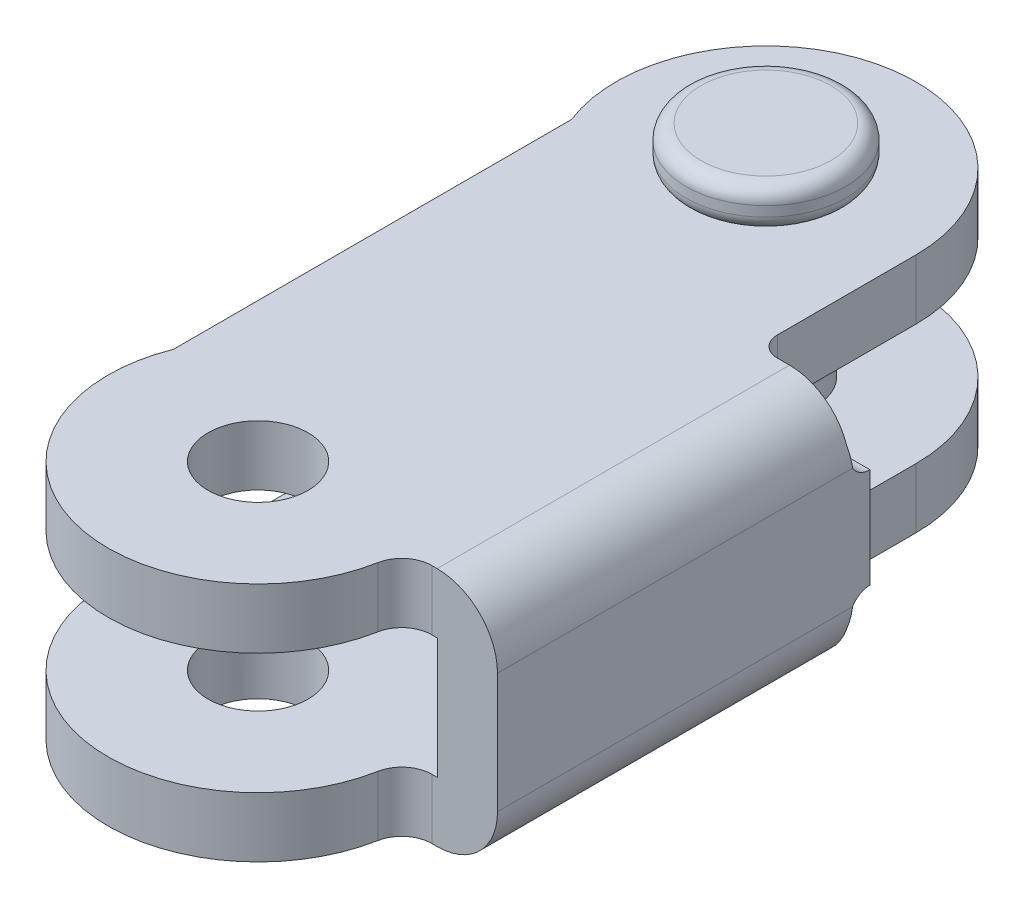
ISO-10303-21;
HEADER;
FILE_DESCRIPTION(('STEP AP214'),'2;1');
FILE_NAME('part.step','',(''),(''),'','','');
FILE_SCHEMA(('AUTOMOTIVE_DESIGN { 1 0 10303 214 1 1 1 1 }'));
ENDSEC;
DATA;
#1=APPLICATION_CONTEXT('core data for automotive mechanical design processes');
#2=APPLICATION_PROTOCOL_DEFINITION('international standard','automotive_design',2000,#1);
#3=PRODUCT_CONTEXT('',#1,'mechanical');
#4=PRODUCT('Part','Part','',(#3));
#5=PRODUCT_RELATED_PRODUCT_CATEGORY('part','',(#4));
#6=PRODUCT_DEFINITION_FORMATION('','',#4);
#7=PRODUCT_DEFINITION_CONTEXT('part definition',#1,'design');
#8=PRODUCT_DEFINITION('design','',#6,#7);
#9=PRODUCT_DEFINITION_SHAPE('','',#8);
#10=(LENGTH_UNIT() NAMED_UNIT(*) SI_UNIT(.MILLI.,.METRE.));
#11=(NAMED_UNIT(*) PLANE_ANGLE_UNIT() SI_UNIT($,.RADIAN.));
#12=(NAMED_UNIT(*) SI_UNIT($,.STERADIAN.) SOLID_ANGLE_UNIT());
#13=UNCERTAINTY_MEASURE_WITH_UNIT(LENGTH_MEASURE(1.E-05),#10,'distance_accuracy_value','');
#14=(GEOMETRIC_REPRESENTATION_CONTEXT(3) GLOBAL_UNCERTAINTY_ASSIGNED_CONTEXT((#13)) GLOBAL_UNIT_ASSIGNED_CONTEXT((#10,
#11,#12)) REPRESENTATION_CONTEXT('',''));
#15=CARTESIAN_POINT('',(0.,0.,0.));
#16=DIRECTION('',(0.,0.,1.));
#17=DIRECTION('',(1.,0.,0.));
#18=AXIS2_PLACEMENT_3D('',#15,#16,#17);
#19=CARTESIAN_POINT('',(1.87350135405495E-13,-8.01999999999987,-1.38777878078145E-12));
#20=DIRECTION('',(0.,-1.,0.));
#21=DIRECTION('',(0.994015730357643,0.,-0.109237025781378));
#22=AXIS2_PLACEMENT_3D('',#19,#20,#21);
#23=PLANE('',#22);
#24=CARTESIAN_POINT('',(1.87350135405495E-13,-8.01999999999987,-1.38777878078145E-12));
#25=DIRECTION('',(0.,-1.,0.));
#26=DIRECTION('',(0.994015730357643,0.,-0.109237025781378));
#27=AXIS2_PLACEMENT_3D('',#24,#25,#26);
#28=CIRCLE('',#27,3.25);
#29=CARTESIAN_POINT('',(3.23055112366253,-8.01999999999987,-0.355020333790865));
#30=VERTEX_POINT('',#29);
#31=EDGE_CURVE('E531',#30,#30,#28,.T.);
#32=ORIENTED_EDGE('',*,*,#31,.T.);
#33=EDGE_LOOP('',(#32));
#34=FACE_BOUND('',#33,.T.);
#35=ADVANCED_FACE('F14',(#34),#23,.T.);
#36=CARTESIAN_POINT('',(1.94289029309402E-13,-7.26999999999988,-1.38777878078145E-12));
#37=DIRECTION('',(0.,-1.,0.));
#38=DIRECTION('',(0.994015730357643,0.,-0.109237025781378));
#39=AXIS2_PLACEMENT_3D('',#36,#37,#38);
#40=TOROIDAL_SURFACE('',#39,3.25,0.75);
#41=ORIENTED_EDGE('',*,*,#31,.F.);
#42=EDGE_LOOP('',(#41));
#43=FACE_BOUND('',#42,.T.);
#44=CARTESIAN_POINT('',(1.94289029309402E-13,-7.26999999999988,-1.38777878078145E-12));
#45=DIRECTION('',(0.,1.,0.));
#46=DIRECTION('',(0.994015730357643,0.,-0.109237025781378));
#47=AXIS2_PLACEMENT_3D('',#44,#45,#46);
#48=CIRCLE('',#47,4.);
#49=CARTESIAN_POINT('',(3.97606292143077,-7.26999999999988,-0.436948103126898));
#50=VERTEX_POINT('',#49);
#51=EDGE_CURVE('E890',#50,#50,#48,.T.);
#52=ORIENTED_EDGE('',*,*,#51,.F.);
#53=EDGE_LOOP('',(#52));
#54=FACE_BOUND('',#53,.T.);
#55=ADVANCED_FACE('F872',(#43,#54),#40,.T.);
#56=CARTESIAN_POINT('',(0.,-6.01999999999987,-1.39471767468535E-12));
#57=DIRECTION('',(0.,-1.,0.));
#58=DIRECTION('',(0.994015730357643,0.,-0.109237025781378));
#59=AXIS2_PLACEMENT_3D('',#56,#57,#58);
#60=CYLINDRICAL_SURFACE('',#59,4.);
#61=ORIENTED_EDGE('',*,*,#51,.T.);
#62=EDGE_LOOP('',(#61));
#63=FACE_BOUND('',#62,.T.);
#64=CARTESIAN_POINT('',(1.94289029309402E-13,-6.76999999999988,-1.38777878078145E-12));
#65=DIRECTION('',(0.,-1.,0.));
#66=DIRECTION('',(-0.994015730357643,0.,0.109237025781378));
#67=AXIS2_PLACEMENT_3D('',#64,#65,#66);
#68=CIRCLE('',#67,4.);
#69=CARTESIAN_POINT('',(-3.97606292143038,-6.76999999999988,0.436948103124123));
#70=VERTEX_POINT('',#69);
#71=EDGE_CURVE('E893',#70,#70,#68,.T.);
#72=ORIENTED_EDGE('',*,*,#71,.T.);
#73=EDGE_LOOP('',(#72));
#74=FACE_BOUND('',#73,.T.);
#75=ADVANCED_FACE('F858',(#63,#74),#60,.T.);
#76=CARTESIAN_POINT('',(1.94289029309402E-13,-6.76999999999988,-1.38777878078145E-12));
#77=DIRECTION('',(0.,1.,0.));
#78=DIRECTION('',(-0.994015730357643,0.,0.109237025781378));
#79=AXIS2_PLACEMENT_3D('',#76,#77,#78);
#80=TOROIDAL_SURFACE('',#79,3.25,0.75);
#81=CARTESIAN_POINT('',(0.,-6.01999999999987,-1.39471767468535E-12));
#82=DIRECTION('',(0.,1.,0.));
#83=DIRECTION('',(-0.994015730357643,0.,0.109237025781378));
#84=AXIS2_PLACEMENT_3D('',#81,#82,#83);
#85=CIRCLE('',#84,3.25);
#86=CARTESIAN_POINT('',(-3.23055112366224,-6.01999999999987,0.355020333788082));
#87=VERTEX_POINT('',#86);
#88=EDGE_CURVE('E916',#87,#87,#85,.T.);
#89=ORIENTED_EDGE('',*,*,#88,.F.);
#90=EDGE_LOOP('',(#89));
#91=FACE_BOUND('',#90,.T.);
#92=ORIENTED_EDGE('',*,*,#71,.F.);
#93=EDGE_LOOP('',(#92));
#94=FACE_BOUND('',#93,.T.);
#95=ADVANCED_FACE('F856',(#91,#94),#80,.T.);
#96=CARTESIAN_POINT('',(1.87350135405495E-13,-8.01999999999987,-1.38777878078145E-12));
#97=DIRECTION('',(0.,1.,0.));
#98=DIRECTION('',(-0.994015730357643,0.,0.109237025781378));
#99=AXIS2_PLACEMENT_3D('',#96,#97,#98);
#100=CYLINDRICAL_SURFACE('',#99,2.5);
#101=CARTESIAN_POINT('',(1.31838984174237E-13,3.02,-1.39471767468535E-12));
#102=DIRECTION('',(0.,-1.,0.));
#103=DIRECTION('',(0.99903193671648,0.,0.0439907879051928));
#104=AXIS2_PLACEMENT_3D('',#101,#102,#103);
#105=CIRCLE('',#104,2.5);
#106=CARTESIAN_POINT('',(2.49757984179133,3.02000000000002,0.109976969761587));
#107=VERTEX_POINT('',#106);
#108=EDGE_CURVE('E9',#107,#107,#105,.F.);
#109=ORIENTED_EDGE('',*,*,#108,.F.);
#110=EDGE_LOOP('',(#109));
#111=FACE_BOUND('',#110,.T.);
#112=CARTESIAN_POINT('',(1.11022302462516E-13,-3.01999999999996,-1.39471767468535E-12));
#113=DIRECTION('',(0.,1.,0.));
#114=DIRECTION('',(-0.99903193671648,0.,-0.0439907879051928));
#115=AXIS2_PLACEMENT_3D('',#112,#113,#114);
#116=CIRCLE('',#115,2.5);
#117=CARTESIAN_POINT('',(-2.49757984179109,-3.01999999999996,-0.109976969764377));
#118=VERTEX_POINT('',#117);
#119=EDGE_CURVE('E24',#118,#118,#116,.F.);
#120=ORIENTED_EDGE('',*,*,#119,.F.);
#121=EDGE_LOOP('',(#120));
#122=FACE_BOUND('',#121,.T.);
#123=ADVANCED_FACE('F376',(#111,#122),#100,.T.);
#124=CARTESIAN_POINT('',(1.45716771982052E-13,7.98000000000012,-1.39471767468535E-12));
#125=DIRECTION('',(0.,-1.,0.));
#126=DIRECTION('',(0.994015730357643,0.,-0.109237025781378));
#127=AXIS2_PLACEMENT_3D('',#124,#125,#126);
#128=PLANE('',#127);
#129=CARTESIAN_POINT('',(1.45716771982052E-13,7.98000000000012,-1.39471767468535E-12));
#130=DIRECTION('',(0.,1.,0.));
#131=DIRECTION('',(0.994015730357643,0.,-0.109237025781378));
#132=AXIS2_PLACEMENT_3D('',#129,#130,#131);
#133=CIRCLE('',#132,3.25);
#134=CARTESIAN_POINT('',(3.23055112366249,7.98000000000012,-0.355020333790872));
#135=VERTEX_POINT('',#134);
#136=EDGE_CURVE('E912',#135,#135,#133,.T.);
#137=ORIENTED_EDGE('',*,*,#136,.T.);
#138=EDGE_LOOP('',(#137));
#139=FACE_BOUND('',#138,.T.);
#140=ADVANCED_FACE('F860',(#139),#128,.F.);
#141=CARTESIAN_POINT('',(1.45716771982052E-13,7.23000000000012,-1.39471767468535E-12));
#142=DIRECTION('',(0.,-1.,0.));
#143=DIRECTION('',(0.994015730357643,0.,-0.109237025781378));
#144=AXIS2_PLACEMENT_3D('',#141,#142,#143);
#145=TOROIDAL_SURFACE('',#144,3.25,0.75);
#146=CARTESIAN_POINT('',(1.45716771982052E-13,7.23000000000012,-1.39471767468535E-12));
#147=DIRECTION('',(0.,-1.,0.));
#148=DIRECTION('',(0.994015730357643,0.,-0.109237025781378));
#149=AXIS2_PLACEMENT_3D('',#146,#147,#148);
#150=CIRCLE('',#149,4.);
#151=CARTESIAN_POINT('',(3.97606292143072,7.23000000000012,-0.436948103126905));
#152=VERTEX_POINT('',#151);
#153=EDGE_CURVE('E908',#152,#152,#150,.T.);
#154=ORIENTED_EDGE('',*,*,#153,.F.);
#155=EDGE_LOOP('',(#154));
#156=FACE_BOUND('',#155,.T.);
#157=ORIENTED_EDGE('',*,*,#136,.F.);
#158=EDGE_LOOP('',(#157));
#159=FACE_BOUND('',#158,.T.);
#160=ADVANCED_FACE('F865',(#156,#159),#145,.T.);
#161=CARTESIAN_POINT('',(1.38777878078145E-13,5.98000000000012,-1.39471767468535E-12));
#162=DIRECTION('',(0.,1.,0.));
#163=DIRECTION('',(-0.994015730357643,0.,0.109237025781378));
#164=AXIS2_PLACEMENT_3D('',#161,#162,#163);
#165=CYLINDRICAL_SURFACE('',#164,4.);
#166=ORIENTED_EDGE('',*,*,#153,.T.);
#167=EDGE_LOOP('',(#166));
#168=FACE_BOUND('',#167,.T.);
#169=CARTESIAN_POINT('',(1.45716771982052E-13,6.73000000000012,-1.39471767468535E-12));
#170=DIRECTION('',(0.,1.,0.));
#171=DIRECTION('',(0.994015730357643,0.,-0.109237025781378));
#172=AXIS2_PLACEMENT_3D('',#169,#170,#171);
#173=CIRCLE('',#172,4.);
#174=CARTESIAN_POINT('',(3.97606292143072,6.73000000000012,-0.436948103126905));
#175=VERTEX_POINT('',#174);
#176=EDGE_CURVE('E903',#175,#175,#173,.T.);
#177=ORIENTED_EDGE('',*,*,#176,.T.);
#178=EDGE_LOOP('',(#177));
#179=FACE_BOUND('',#178,.T.);
#180=ADVANCED_FACE('F373',(#168,#179),#165,.T.);
#181=CARTESIAN_POINT('',(1.45716771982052E-13,6.73000000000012,-1.39471767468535E-12));
#182=DIRECTION('',(0.,-1.,0.));
#183=DIRECTION('',(0.994015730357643,0.,-0.109237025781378));
#184=AXIS2_PLACEMENT_3D('',#181,#182,#183);
#185=TOROIDAL_SURFACE('',#184,3.25,0.75);
#186=CARTESIAN_POINT('',(1.38777878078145E-13,6.02,-1.39471767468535E-12));
#187=DIRECTION('',(0.,-1.,0.));
#188=DIRECTION('',(0.99903193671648,0.,0.0439907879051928));
#189=AXIS2_PLACEMENT_3D('',#186,#187,#188);
#190=CIRCLE('',#189,3.49166091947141);
#191=CARTESIAN_POINT('',(3.48828077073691,6.02000000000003,0.153600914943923));
#192=VERTEX_POINT('',#191);
#193=EDGE_CURVE('E896',#192,#192,#190,.F.);
#194=ORIENTED_EDGE('',*,*,#193,.T.);
#195=EDGE_LOOP('',(#194));
#196=FACE_BOUND('',#195,.T.);
#197=ORIENTED_EDGE('',*,*,#176,.F.);
#198=EDGE_LOOP('',(#197));
#199=FACE_BOUND('',#198,.T.);
#200=ADVANCED_FACE('F364',(#196,#199),#185,.T.);
#201=CARTESIAN_POINT('',(9.13240216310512,5.65405101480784,25.5579999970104));
#202=DIRECTION('',(0.,0.,-1.));
#203=DIRECTION('',(1.,0.,0.));
#204=AXIS2_PLACEMENT_3D('',#201,#202,#203);
#205=PLANE('',#204);
#206=DIRECTION('',(0.,1.,0.));
#207=VECTOR('',#206,1.);
#208=CARTESIAN_POINT('',(9.13240216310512,5.65405101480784,25.5579999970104));
#209=LINE('',#208,#207);
#210=CARTESIAN_POINT('',(9.13240216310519,-2.99999999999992,25.5579999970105));
#211=VERTEX_POINT('',#210);
#212=CARTESIAN_POINT('',(9.13240216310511,3.0000000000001,25.5579999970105));
#213=VERTEX_POINT('',#212);
#214=EDGE_CURVE('E577',#211,#213,#209,.T.);
#215=ORIENTED_EDGE('',*,*,#214,.F.);
#216=CARTESIAN_POINT('',(9.11240216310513,-2.99999999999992,25.5579999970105));
#217=DIRECTION('',(0.,0.,1.));
#218=DIRECTION('',(-1.,0.,0.));
#219=AXIS2_PLACEMENT_3D('',#216,#217,#218);
#220=CIRCLE('',#219,0.02);
#221=CARTESIAN_POINT('',(9.11240216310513,-3.01999999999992,25.5579999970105));
#222=VERTEX_POINT('',#221);
#223=EDGE_CURVE('E597',#222,#211,#220,.T.);
#224=ORIENTED_EDGE('',*,*,#223,.F.);
#225=DIRECTION('',(1.,0.,0.));
#226=VECTOR('',#225,1.);
#227=CARTESIAN_POINT('',(20.1540635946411,-3.01999999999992,25.5579999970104));
#228=LINE('',#227,#226);
#229=CARTESIAN_POINT('',(8.84596156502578,-3.01999999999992,25.5579999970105));
#230=VERTEX_POINT('',#229);
#231=EDGE_CURVE('E636',#230,#222,#228,.T.);
#232=ORIENTED_EDGE('',*,*,#231,.F.);
#233=DIRECTION('',(0.,-1.,0.));
#234=VECTOR('',#233,1.);
#235=CARTESIAN_POINT('',(8.84596156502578,-3.01999999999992,25.5579999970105));
#236=LINE('',#235,#234);
#237=CARTESIAN_POINT('',(8.84596156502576,-6.01999999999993,25.5579999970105));
#238=VERTEX_POINT('',#237);
#239=EDGE_CURVE('E667',#230,#238,#236,.T.);
#240=ORIENTED_EDGE('',*,*,#239,.T.);
#241=DIRECTION('',(1.,0.,0.));
#242=VECTOR('',#241,1.);
#243=CARTESIAN_POINT('',(20.1540635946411,-6.01999999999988,25.5579999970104));
#244=LINE('',#243,#242);
#245=CARTESIAN_POINT('',(9.11240216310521,-6.01999999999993,25.5579999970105));
#246=VERTEX_POINT('',#245);
#247=EDGE_CURVE('E271',#238,#246,#244,.T.);
#248=ORIENTED_EDGE('',*,*,#247,.T.);
#249=CARTESIAN_POINT('',(9.11240216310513,-2.99999999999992,25.5579999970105));
#250=DIRECTION('',(0.,0.,1.));
#251=DIRECTION('',(0.,1.,0.));
#252=AXIS2_PLACEMENT_3D('',#249,#250,#251);
#253=CIRCLE('',#252,3.02);
#254=CARTESIAN_POINT('',(12.1324021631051,-2.99999999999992,25.5579999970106));
#255=VERTEX_POINT('',#254);
#256=EDGE_CURVE('E474',#246,#255,#253,.T.);
#257=ORIENTED_EDGE('',*,*,#256,.T.);
#258=DIRECTION('',(0.,1.,0.));
#259=VECTOR('',#258,1.);
#260=CARTESIAN_POINT('',(12.1324021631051,5.65405101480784,25.5579999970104));
#261=LINE('',#260,#259);
#262=CARTESIAN_POINT('',(12.1324021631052,3.00000000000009,25.5579999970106));
#263=VERTEX_POINT('',#262);
#264=EDGE_CURVE('E491',#255,#263,#261,.T.);
#265=ORIENTED_EDGE('',*,*,#264,.T.);
#266=CARTESIAN_POINT('',(9.11240216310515,3.0000000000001,25.5579999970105));
#267=DIRECTION('',(0.,0.,1.));
#268=DIRECTION('',(0.,-1.,0.));
#269=AXIS2_PLACEMENT_3D('',#266,#267,#268);
#270=CIRCLE('',#269,3.02);
#271=CARTESIAN_POINT('',(9.11240216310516,6.0200000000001,25.5579999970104));
#272=VERTEX_POINT('',#271);
#273=EDGE_CURVE('E563',#263,#272,#270,.T.);
#274=ORIENTED_EDGE('',*,*,#273,.T.);
#275=DIRECTION('',(-1.,0.,0.));
#276=VECTOR('',#275,1.);
#277=CARTESIAN_POINT('',(8.84596156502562,6.0200000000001,25.5579999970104));
#278=LINE('',#277,#276);
#279=CARTESIAN_POINT('',(8.84596156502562,6.0200000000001,25.5579999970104));
#280=VERTEX_POINT('',#279);
#281=EDGE_CURVE('E655',#272,#280,#278,.T.);
#282=ORIENTED_EDGE('',*,*,#281,.T.);
#283=DIRECTION('',(0.,1.,0.));
#284=VECTOR('',#283,1.);
#285=CARTESIAN_POINT('',(8.8459615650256,3.0200000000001,25.5579999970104));
#286=LINE('',#285,#284);
#287=CARTESIAN_POINT('',(8.8459615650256,3.0200000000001,25.5579999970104));
#288=VERTEX_POINT('',#287);
#289=EDGE_CURVE('E485',#288,#280,#286,.T.);
#290=ORIENTED_EDGE('',*,*,#289,.F.);
#291=DIRECTION('',(-1.,0.,0.));
#292=VECTOR('',#291,1.);
#293=CARTESIAN_POINT('',(8.8459615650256,3.0200000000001,25.5579999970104));
#294=LINE('',#293,#292);
#295=CARTESIAN_POINT('',(9.11240216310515,3.02000000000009,25.5579999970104));
#296=VERTEX_POINT('',#295);
#297=EDGE_CURVE('E94',#296,#288,#294,.T.);
#298=ORIENTED_EDGE('',*,*,#297,.F.);
#299=CARTESIAN_POINT('',(9.11240216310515,3.0000000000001,25.5579999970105));
#300=DIRECTION('',(0.,0.,1.));
#301=DIRECTION('',(-1.,0.,0.));
#302=AXIS2_PLACEMENT_3D('',#299,#300,#301);
#303=CIRCLE('',#302,0.02);
#304=EDGE_CURVE('E496',#213,#296,#303,.T.);
#305=ORIENTED_EDGE('',*,*,#304,.F.);
#306=EDGE_LOOP('',(#215,#224,#232,#240,#248,#257,#265,#274,#282,#290,#298,#305));
#307=FACE_BOUND('',#306,.T.);
#308=ADVANCED_FACE('F361',(#307),#205,.F.);
#309=CARTESIAN_POINT('',(9.13240216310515,3.499999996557,6.93279998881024));
#310=DIRECTION('',(1.,0.,0.));
#311=DIRECTION('',(0.,1.,0.));
#312=AXIS2_PLACEMENT_3D('',#309,#310,#311);
#313=CYLINDRICAL_SURFACE('',#312,1.);
#314=CARTESIAN_POINT('',(9.13240216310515,3.499999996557,6.93279998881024));
#315=DIRECTION('',(1.,0.,0.));
#316=DIRECTION('',(0.,-1.,0.));
#317=AXIS2_PLACEMENT_3D('',#314,#315,#316);
#318=CIRCLE('',#317,1.);
#319=CARTESIAN_POINT('',(9.13240216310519,3.0000000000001,7.79882539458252));
#320=VERTEX_POINT('',#319);
#321=CARTESIAN_POINT('',(9.13240216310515,2.499999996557,6.93279998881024));
#322=VERTEX_POINT('',#321);
#323=EDGE_CURVE('E580',#320,#322,#318,.T.);
#324=ORIENTED_EDGE('',*,*,#323,.F.);
#325=CARTESIAN_POINT('',(9.13240216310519,3.0000000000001,7.79882539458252));
#326=CARTESIAN_POINT('',(10.1324021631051,3.00000000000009,7.79882539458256));
#327=CARTESIAN_POINT('',(11.1324021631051,3.00000000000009,7.79882539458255));
#328=CARTESIAN_POINT('',(12.1324021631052,3.00000000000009,7.79882539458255));
#329=(BOUNDED_CURVE() B_SPLINE_CURVE(3,(#325,#326,#327,#328),.UNSPECIFIED.,.F.,
.F.) B_SPLINE_CURVE_WITH_KNOTS((4,4),(0.,1.),
.UNSPECIFIED.) CURVE() GEOMETRIC_REPRESENTATION_ITEM() RATIONAL_B_SPLINE_CURVE((1.,1.,1.,1.)) REPRESENTATION_ITEM(''));
#330=CARTESIAN_POINT('',(12.1324021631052,3.00000000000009,7.79882539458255));
#331=VERTEX_POINT('',#330);
#332=EDGE_CURVE('E800',#320,#331,#329,.T.);
#333=ORIENTED_EDGE('',*,*,#332,.T.);
#334=CARTESIAN_POINT('',(12.1324021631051,3.49999999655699,6.93279998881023));
#335=DIRECTION('',(1.,0.,0.));
#336=DIRECTION('',(0.,-1.,0.));
#337=AXIS2_PLACEMENT_3D('',#334,#335,#336);
#338=CIRCLE('',#337,1.);
#339=CARTESIAN_POINT('',(12.1324021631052,2.49999999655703,6.93279998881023));
#340=VERTEX_POINT('',#339);
#341=EDGE_CURVE('E552',#331,#340,#338,.T.);
#342=ORIENTED_EDGE('',*,*,#341,.T.);
#343=DIRECTION('',(1.,0.,0.));
#344=VECTOR('',#343,1.);
#345=CARTESIAN_POINT('',(9.13240216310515,2.499999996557,6.93279998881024));
#346=LINE('',#345,#344);
#347=EDGE_CURVE('E492',#322,#340,#346,.T.);
#348=ORIENTED_EDGE('',*,*,#347,.F.);
#349=EDGE_LOOP('',(#324,#333,#342,#348));
#350=FACE_BOUND('',#349,.T.);
#351=ADVANCED_FACE('F363',(#350),#313,.F.);
#352=CARTESIAN_POINT('',(9.13240216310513,-2.50000000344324,6.93279998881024));
#353=DIRECTION('',(0.,0.,1.));
#354=DIRECTION('',(0.,-1.,0.));
#355=AXIS2_PLACEMENT_3D('',#352,#353,#354);
#356=PLANE('',#355);
#357=DIRECTION('',(0.,-1.,0.));
#358=VECTOR('',#357,1.);
#359=CARTESIAN_POINT('',(12.1324021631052,-2.50000000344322,6.93279998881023));
#360=LINE('',#359,#358);
#361=CARTESIAN_POINT('',(12.1324021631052,-2.50000000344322,6.93279998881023));
#362=VERTEX_POINT('',#361);
#363=EDGE_CURVE('E487',#340,#362,#360,.T.);
#364=ORIENTED_EDGE('',*,*,#363,.T.);
#365=DIRECTION('',(1.,0.,0.));
#366=VECTOR('',#365,1.);
#367=CARTESIAN_POINT('',(9.13240216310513,-2.50000000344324,6.93279998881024));
#368=LINE('',#367,#366);
#369=CARTESIAN_POINT('',(9.13240216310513,-2.50000000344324,6.93279998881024));
#370=VERTEX_POINT('',#369);
#371=EDGE_CURVE('E702',#370,#362,#368,.T.);
#372=ORIENTED_EDGE('',*,*,#371,.F.);
#373=DIRECTION('',(0.,-1.,0.));
#374=VECTOR('',#373,1.);
#375=CARTESIAN_POINT('',(9.13240216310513,-2.50000000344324,6.93279998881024));
#376=LINE('',#375,#374);
#377=EDGE_CURVE('E578',#322,#370,#376,.T.);
#378=ORIENTED_EDGE('',*,*,#377,.F.);
#379=ORIENTED_EDGE('',*,*,#347,.T.);
#380=EDGE_LOOP('',(#364,#372,#378,#379));
#381=FACE_BOUND('',#380,.T.);
#382=ADVANCED_FACE('F357',(#381),#356,.F.);
#383=CARTESIAN_POINT('',(9.13240216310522,-3.50000000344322,6.93279998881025));
#384=DIRECTION('',(1.,0.,0.));
#385=DIRECTION('',(0.,1.,0.));
#386=AXIS2_PLACEMENT_3D('',#383,#384,#385);
#387=CYLINDRICAL_SURFACE('',#386,1.);
#388=CARTESIAN_POINT('',(9.13240216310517,-2.99999999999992,7.79882539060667));
#389=CARTESIAN_POINT('',(12.1324021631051,-2.99999999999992,7.7988253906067));
#390=(BOUNDED_CURVE() B_SPLINE_CURVE(1,(#388,#389),.UNSPECIFIED.,.F.,
.F.) B_SPLINE_CURVE_WITH_KNOTS((2,2),(0.,1.),
.UNSPECIFIED.) CURVE() GEOMETRIC_REPRESENTATION_ITEM() RATIONAL_B_SPLINE_CURVE((1.,1.)) REPRESENTATION_ITEM(''));
#391=CARTESIAN_POINT('',(9.13240216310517,-2.99999999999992,7.79882539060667));
#392=VERTEX_POINT('',#391);
#393=CARTESIAN_POINT('',(12.1324021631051,-2.99999999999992,7.7988253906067));
#394=VERTEX_POINT('',#393);
#395=EDGE_CURVE('E469',#392,#394,#390,.T.);
#396=ORIENTED_EDGE('',*,*,#395,.F.);
#397=CARTESIAN_POINT('',(9.13240216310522,-3.50000000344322,6.93279998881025));
#398=DIRECTION('',(1.,0.,0.));
#399=DIRECTION('',(0.,-1.,0.));
#400=AXIS2_PLACEMENT_3D('',#397,#398,#399);
#401=CIRCLE('',#400,1.);
#402=EDGE_CURVE('E576',#370,#392,#401,.T.);
#403=ORIENTED_EDGE('',*,*,#402,.F.);
#404=ORIENTED_EDGE('',*,*,#371,.T.);
#405=CARTESIAN_POINT('',(12.1324021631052,-3.50000000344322,6.93279998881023));
#406=DIRECTION('',(1.,0.,0.));
#407=DIRECTION('',(0.,-1.,0.));
#408=AXIS2_PLACEMENT_3D('',#405,#406,#407);
#409=CIRCLE('',#408,1.);
#410=EDGE_CURVE('E706',#362,#394,#409,.T.);
#411=ORIENTED_EDGE('',*,*,#410,.T.);
#412=EDGE_LOOP('',(#396,#403,#404,#411));
#413=FACE_BOUND('',#412,.T.);
#414=ADVANCED_FACE('F347',(#413),#387,.F.);
#415=CARTESIAN_POINT('',(9.13240216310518,-5.65405101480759,27.0579999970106));
#416=DIRECTION('',(-1.,0.,0.));
#417=DIRECTION('',(0.,-1.,0.));
#418=AXIS2_PLACEMENT_3D('',#415,#416,#417);
#419=PLANE('',#418);
#420=ORIENTED_EDGE('',*,*,#402,.T.);
#421=DIRECTION('',(0.,0.,1.));
#422=VECTOR('',#421,1.);
#423=CARTESIAN_POINT('',(9.13240216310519,-2.99999999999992,27.0579999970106));
#424=LINE('',#423,#422);
#425=EDGE_CURVE('E572',#392,#211,#424,.T.);
#426=ORIENTED_EDGE('',*,*,#425,.T.);
#427=ORIENTED_EDGE('',*,*,#214,.T.);
#428=DIRECTION('',(0.,0.,1.));
#429=VECTOR('',#428,1.);
#430=CARTESIAN_POINT('',(9.13240216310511,3.0000000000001,27.0579999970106));
#431=LINE('',#430,#429);
#432=EDGE_CURVE('E560',#320,#213,#431,.T.);
#433=ORIENTED_EDGE('',*,*,#432,.F.);
#434=ORIENTED_EDGE('',*,*,#323,.T.);
#435=ORIENTED_EDGE('',*,*,#377,.T.);
#436=EDGE_LOOP('',(#420,#426,#427,#433,#434,#435));
#437=FACE_BOUND('',#436,.T.);
#438=ADVANCED_FACE('F345',(#437),#419,.T.);
#439=CARTESIAN_POINT('',(9.11240216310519,3.0000000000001,7.93279998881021));
#440=DIRECTION('',(0.,0.,1.));
#441=DIRECTION('',(0.,-1.,0.));
#442=AXIS2_PLACEMENT_3D('',#439,#440,#441);
#443=PLANE('',#442);
#444=CARTESIAN_POINT('',(9.11240216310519,3.0000000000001,7.93279998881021));
#445=DIRECTION('',(0.,0.,-1.));
#446=DIRECTION('',(1.,0.,0.));
#447=AXIS2_PLACEMENT_3D('',#444,#445,#446);
#448=CIRCLE('',#447,0.02);
#449=CARTESIAN_POINT('',(9.11240216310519,3.02000000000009,7.93279998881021));
#450=VERTEX_POINT('',#449);
#451=CARTESIAN_POINT('',(9.13132982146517,3.00646094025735,7.93279998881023));
#452=VERTEX_POINT('',#451);
#453=EDGE_CURVE('E493',#450,#452,#448,.T.);
#454=ORIENTED_EDGE('',*,*,#453,.F.);
#455=DIRECTION('',(1.,0.,0.));
#456=VECTOR('',#455,1.);
#457=CARTESIAN_POINT('',(11.0000125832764,3.02000000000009,7.93279998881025));
#458=LINE('',#457,#456);
#459=CARTESIAN_POINT('',(8.5,3.02000000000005,7.93279998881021));
#460=VERTEX_POINT('',#459);
#461=EDGE_CURVE('E610',#460,#450,#458,.T.);
#462=ORIENTED_EDGE('',*,*,#461,.F.);
#463=DIRECTION('',(0.,1.,0.));
#464=VECTOR('',#463,1.);
#465=CARTESIAN_POINT('',(8.5,3.02000000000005,7.93279998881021));
#466=LINE('',#465,#464);
#467=CARTESIAN_POINT('',(8.49999999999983,6.0200000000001,7.93279998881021));
#468=VERTEX_POINT('',#467);
#469=EDGE_CURVE('E613',#460,#468,#466,.T.);
#470=ORIENTED_EDGE('',*,*,#469,.T.);
#471=DIRECTION('',(1.,0.,0.));
#472=VECTOR('',#471,1.);
#473=CARTESIAN_POINT('',(11.0000125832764,6.02000000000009,7.93279998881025));
#474=LINE('',#473,#472);
#475=CARTESIAN_POINT('',(9.11240216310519,6.0200000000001,7.93279998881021));
#476=VERTEX_POINT('',#475);
#477=EDGE_CURVE('E473',#468,#476,#474,.T.);
#478=ORIENTED_EDGE('',*,*,#477,.T.);
#479=CARTESIAN_POINT('',(9.11240216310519,3.0000000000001,7.93279998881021));
#480=DIRECTION('',(0.,0.,-1.));
#481=DIRECTION('',(0.,-1.,0.));
#482=AXIS2_PLACEMENT_3D('',#479,#480,#481);
#483=CIRCLE('',#482,3.02);
#484=CARTESIAN_POINT('',(11.9704785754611,3.97560197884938,7.93279998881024));
#485=VERTEX_POINT('',#484);
#486=EDGE_CURVE('E750',#476,#485,#483,.T.);
#487=ORIENTED_EDGE('',*,*,#486,.T.);
#488=CARTESIAN_POINT('',(11.9704785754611,3.97560197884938,7.93279998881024));
#489=CARTESIAN_POINT('',(11.0240956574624,3.65255496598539,7.93279998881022));
#490=CARTESIAN_POINT('',(10.0777127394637,3.32950795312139,7.93279998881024));
#491=CARTESIAN_POINT('',(9.13132982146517,3.00646094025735,7.93279998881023));
#492=(BOUNDED_CURVE() B_SPLINE_CURVE(3,(#488,#489,#490,#491),.UNSPECIFIED.,.F.,
.F.) B_SPLINE_CURVE_WITH_KNOTS((4,4),(0.,1.),
.UNSPECIFIED.) CURVE() GEOMETRIC_REPRESENTATION_ITEM() RATIONAL_B_SPLINE_CURVE((1.,1.,1.,1.)) REPRESENTATION_ITEM(''));
#493=EDGE_CURVE('E780',#485,#452,#492,.T.);
#494=ORIENTED_EDGE('',*,*,#493,.T.);
#495=EDGE_LOOP('',(#454,#462,#470,#478,#487,#494));
#496=FACE_BOUND('',#495,.T.);
#497=ADVANCED_FACE('F313',(#496),#443,.F.);
#498=CARTESIAN_POINT('',(11.9704785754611,3.97560197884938,7.93279998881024));
#499=CARTESIAN_POINT('',(12.0774848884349,3.66212145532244,7.88812825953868));
#500=CARTESIAN_POINT('',(12.1324021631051,3.33124068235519,7.84349712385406));
#501=CARTESIAN_POINT('',(12.1324021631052,3.00000000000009,7.79882539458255));
#502=CARTESIAN_POINT('',(9.13132982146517,3.00646094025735,7.93279998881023));
#503=CARTESIAN_POINT('',(9.13203825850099,3.00438553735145,7.88814175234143));
#504=CARTESIAN_POINT('',(9.13240216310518,3.00219298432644,7.84348363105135));
#505=CARTESIAN_POINT('',(9.13240216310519,3.0000000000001,7.79882539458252));
#506=(BOUNDED_SURFACE() B_SPLINE_SURFACE(1,3,((#498,#499,#500,#501),(#502,#503,#504,#505)),
.UNSPECIFIED.,.F.,.F.,.F.) B_SPLINE_SURFACE_WITH_KNOTS((2,2),(4,4),(0.,1.),(0.,1.),
.UNSPECIFIED.) GEOMETRIC_REPRESENTATION_ITEM() RATIONAL_B_SPLINE_SURFACE(((1.,1.,1.,1.),(1.,1.,
1.,1.))) REPRESENTATION_ITEM('') SURFACE());
#507=CARTESIAN_POINT('',(11.9704785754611,3.97560197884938,7.93279998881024));
#508=CARTESIAN_POINT('',(12.0774848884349,3.66212145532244,7.88812825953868));
#509=CARTESIAN_POINT('',(12.1324021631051,3.33124068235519,7.84349712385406));
#510=CARTESIAN_POINT('',(12.1324021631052,3.00000000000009,7.79882539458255));
#511=(BOUNDED_CURVE() B_SPLINE_CURVE(3,(#507,#508,#509,#510),.UNSPECIFIED.,.F.,
.F.) B_SPLINE_CURVE_WITH_KNOTS((4,4),(0.,1.),
.UNSPECIFIED.) CURVE() GEOMETRIC_REPRESENTATION_ITEM() RATIONAL_B_SPLINE_CURVE((1.,1.,1.,1.)) REPRESENTATION_ITEM(''));
#512=EDGE_CURVE('E294',#485,#331,#511,.T.);
#513=CARTESIAN_POINT('',(9.13132982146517,3.00646094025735,7.93279998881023));
#514=CARTESIAN_POINT('',(9.13203825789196,3.00438553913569,7.88814179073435));
#515=CARTESIAN_POINT('',(9.13240216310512,3.0021929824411,7.84348359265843));
#516=CARTESIAN_POINT('',(9.13240216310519,3.0000000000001,7.79882539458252));
#517=(BOUNDED_CURVE() B_SPLINE_CURVE(3,(#513,#514,#515,#516),.UNSPECIFIED.,.F.,
.F.) B_SPLINE_CURVE_WITH_KNOTS((4,4),(0.,1.),
.UNSPECIFIED.) CURVE() GEOMETRIC_REPRESENTATION_ITEM() RATIONAL_B_SPLINE_CURVE((1.,1.,1.,1.)) REPRESENTATION_ITEM(''));
#518=EDGE_CURVE('E497',#452,#320,#517,.T.);
#519=ORIENTED_EDGE('',*,*,#493,.F.);
#520=ORIENTED_EDGE('',*,*,#512,.T.);
#521=ORIENTED_EDGE('',*,*,#332,.F.);
#522=ORIENTED_EDGE('',*,*,#518,.F.);
#523=EDGE_LOOP('',(#519,#520,#521,#522));
#524=FACE_BOUND('',#523,.T.);
#525=ADVANCED_FACE('F300',(#524),#506,.F.);
#526=CARTESIAN_POINT('',(12.1324021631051,-3.00000000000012,7.7988253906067));
#527=CARTESIAN_POINT('',(12.1324021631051,-3.33124068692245,7.84349712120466));
#528=CARTESIAN_POINT('',(12.0774848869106,-3.66212146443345,7.88812825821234));
#529=CARTESIAN_POINT('',(11.9704785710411,-3.975601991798,7.93279998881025));
#530=CARTESIAN_POINT('',(9.13240216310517,-2.99999999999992,7.79882539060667));
#531=CARTESIAN_POINT('',(9.13240216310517,-3.00219298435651,7.84348362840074));
#532=CARTESIAN_POINT('',(9.13203825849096,-3.00438553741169,7.88814175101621));
#533=CARTESIAN_POINT('',(9.13132982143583,-3.00646094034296,7.93279998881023));
#534=(BOUNDED_SURFACE() B_SPLINE_SURFACE(1,3,((#526,#527,#528,#529),(#530,#531,#532,#533)),
.UNSPECIFIED.,.F.,.F.,.F.) B_SPLINE_SURFACE_WITH_KNOTS((2,2),(4,4),(0.,1.),(0.,1.),
.UNSPECIFIED.) GEOMETRIC_REPRESENTATION_ITEM() RATIONAL_B_SPLINE_SURFACE(((1.,1.,1.,1.),(1.,1.,
1.,1.))) REPRESENTATION_ITEM('') SURFACE());
#535=CARTESIAN_POINT('',(12.1324021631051,-3.00000000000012,7.7988253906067));
#536=CARTESIAN_POINT('',(12.1324021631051,-3.33124068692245,7.84349712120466));
#537=CARTESIAN_POINT('',(12.0774848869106,-3.66212146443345,7.88812825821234));
#538=CARTESIAN_POINT('',(11.9704785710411,-3.975601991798,7.93279998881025));
#539=(BOUNDED_CURVE() B_SPLINE_CURVE(3,(#535,#536,#537,#538),.UNSPECIFIED.,.F.,
.F.) B_SPLINE_CURVE_WITH_KNOTS((4,4),(0.,1.),
.UNSPECIFIED.) CURVE() GEOMETRIC_REPRESENTATION_ITEM() RATIONAL_B_SPLINE_CURVE((1.,1.,1.,1.)) REPRESENTATION_ITEM(''));
#540=CARTESIAN_POINT('',(11.9704785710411,-3.975601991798,7.93279998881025));
#541=VERTEX_POINT('',#540);
#542=EDGE_CURVE('E411',#394,#541,#539,.T.);
#543=CARTESIAN_POINT('',(11.9704785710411,-3.975601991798,7.93279998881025));
#544=CARTESIAN_POINT('',(9.13132982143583,-3.00646094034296,7.93279998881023));
#545=(BOUNDED_CURVE() B_SPLINE_CURVE(1,(#543,#544),.UNSPECIFIED.,.F.,
.F.) B_SPLINE_CURVE_WITH_KNOTS((2,2),(0.,1.),
.UNSPECIFIED.) CURVE() GEOMETRIC_REPRESENTATION_ITEM() RATIONAL_B_SPLINE_CURVE((1.,1.)) REPRESENTATION_ITEM(''));
#546=CARTESIAN_POINT('',(9.13132982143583,-3.00646094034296,7.93279998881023));
#547=VERTEX_POINT('',#546);
#548=EDGE_CURVE('E460',#541,#547,#545,.T.);
#549=CARTESIAN_POINT('',(9.13240216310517,-2.99999999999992,7.79882539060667));
#550=CARTESIAN_POINT('',(9.13240216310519,-3.00219298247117,7.84348359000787));
#551=CARTESIAN_POINT('',(9.13203825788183,-3.0043855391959,7.88814178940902));
#552=CARTESIAN_POINT('',(9.13132982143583,-3.00646094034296,7.93279998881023));
#553=(BOUNDED_CURVE() B_SPLINE_CURVE(3,(#549,#550,#551,#552),.UNSPECIFIED.,.F.,
.F.) B_SPLINE_CURVE_WITH_KNOTS((4,4),(0.,1.),
.UNSPECIFIED.) CURVE() GEOMETRIC_REPRESENTATION_ITEM() RATIONAL_B_SPLINE_CURVE((1.,1.,1.,1.)) REPRESENTATION_ITEM(''));
#554=EDGE_CURVE('E650',#392,#547,#553,.T.);
#555=ORIENTED_EDGE('',*,*,#542,.T.);
#556=ORIENTED_EDGE('',*,*,#548,.T.);
#557=ORIENTED_EDGE('',*,*,#554,.F.);
#558=ORIENTED_EDGE('',*,*,#395,.T.);
#559=EDGE_LOOP('',(#555,#556,#557,#558));
#560=FACE_BOUND('',#559,.T.);
#561=ADVANCED_FACE('F312',(#560),#534,.F.);
#562=CARTESIAN_POINT('',(12.1324021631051,-5.65405101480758,27.0579999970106));
#563=DIRECTION('',(-1.,0.,0.));
#564=DIRECTION('',(0.,-1.,0.));
#565=AXIS2_PLACEMENT_3D('',#562,#563,#564);
#566=PLANE('',#565);
#567=DIRECTION('',(0.,0.,1.));
#568=VECTOR('',#567,1.);
#569=CARTESIAN_POINT('',(12.1324021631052,-2.99999999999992,27.0579999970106));
#570=LINE('',#569,#568);
#571=EDGE_CURVE('E276',#394,#255,#570,.T.);
#572=ORIENTED_EDGE('',*,*,#571,.F.);
#573=ORIENTED_EDGE('',*,*,#410,.F.);
#574=ORIENTED_EDGE('',*,*,#363,.F.);
#575=ORIENTED_EDGE('',*,*,#341,.F.);
#576=DIRECTION('',(0.,0.,1.));
#577=VECTOR('',#576,1.);
#578=CARTESIAN_POINT('',(12.1324021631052,3.00000000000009,27.0579999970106));
#579=LINE('',#578,#577);
#580=EDGE_CURVE('E581',#331,#263,#579,.T.);
#581=ORIENTED_EDGE('',*,*,#580,.T.);
#582=ORIENTED_EDGE('',*,*,#264,.F.);
#583=EDGE_LOOP('',(#572,#573,#574,#575,#581,#582));
#584=FACE_BOUND('',#583,.T.);
#585=ADVANCED_FACE('F388',(#584),#566,.F.);
#586=CARTESIAN_POINT('',(9.11240216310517,-2.99999999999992,7.93279998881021));
#587=DIRECTION('',(0.,0.,1.));
#588=DIRECTION('',(0.,-1.,0.));
#589=AXIS2_PLACEMENT_3D('',#586,#587,#588);
#590=PLANE('',#589);
#591=ORIENTED_EDGE('',*,*,#548,.F.);
#592=CARTESIAN_POINT('',(9.11240216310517,-2.99999999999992,7.93279998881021));
#593=DIRECTION('',(0.,0.,-1.));
#594=DIRECTION('',(0.,1.,0.));
#595=AXIS2_PLACEMENT_3D('',#592,#593,#594);
#596=CIRCLE('',#595,3.02);
#597=CARTESIAN_POINT('',(9.11240216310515,-6.01999999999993,7.93279998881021));
#598=VERTEX_POINT('',#597);
#599=EDGE_CURVE('E461',#541,#598,#596,.T.);
#600=ORIENTED_EDGE('',*,*,#599,.T.);
#601=DIRECTION('',(-1.,0.,0.));
#602=VECTOR('',#601,1.);
#603=CARTESIAN_POINT('',(11.0000125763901,-6.01999999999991,7.93279998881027));
#604=LINE('',#603,#602);
#605=CARTESIAN_POINT('',(8.4999999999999,-6.02,7.93279998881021));
#606=VERTEX_POINT('',#605);
#607=EDGE_CURVE('E619',#598,#606,#604,.T.);
#608=ORIENTED_EDGE('',*,*,#607,.T.);
#609=DIRECTION('',(0.,-1.,0.));
#610=VECTOR('',#609,1.);
#611=CARTESIAN_POINT('',(8.4999999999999,-3.01999999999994,7.93279998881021));
#612=LINE('',#611,#610);
#613=CARTESIAN_POINT('',(8.4999999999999,-3.01999999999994,7.93279998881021));
#614=VERTEX_POINT('',#613);
#615=EDGE_CURVE('E571',#614,#606,#612,.T.);
#616=ORIENTED_EDGE('',*,*,#615,.F.);
#617=DIRECTION('',(-1.,0.,0.));
#618=VECTOR('',#617,1.);
#619=CARTESIAN_POINT('',(11.0000125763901,-3.01999999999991,7.93279998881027));
#620=LINE('',#619,#618);
#621=CARTESIAN_POINT('',(9.11240216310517,-3.01999999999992,7.93279998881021));
#622=VERTEX_POINT('',#621);
#623=EDGE_CURVE('E502',#622,#614,#620,.T.);
#624=ORIENTED_EDGE('',*,*,#623,.F.);
#625=CARTESIAN_POINT('',(9.11240216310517,-2.99999999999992,7.93279998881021));
#626=DIRECTION('',(0.,0.,-1.));
#627=DIRECTION('',(1.,0.,0.));
#628=AXIS2_PLACEMENT_3D('',#625,#626,#627);
#629=CIRCLE('',#628,0.02);
#630=EDGE_CURVE('E465',#547,#622,#629,.T.);
#631=ORIENTED_EDGE('',*,*,#630,.F.);
#632=EDGE_LOOP('',(#591,#600,#608,#616,#624,#631));
#633=FACE_BOUND('',#632,.T.);
#634=ADVANCED_FACE('F442',(#633),#590,.F.);
#635=CARTESIAN_POINT('',(9.11240216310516,-2.99999999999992,-1.48993797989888));
#636=DIRECTION('',(0.,0.,1.));
#637=DIRECTION('',(0.,1.,0.));
#638=AXIS2_PLACEMENT_3D('',#635,#636,#637);
#639=CYLINDRICAL_SURFACE('',#638,0.02);
#640=ORIENTED_EDGE('',*,*,#425,.F.);
#641=ORIENTED_EDGE('',*,*,#554,.T.);
#642=ORIENTED_EDGE('',*,*,#630,.T.);
#643=DIRECTION('',(0.,0.,1.));
#644=VECTOR('',#643,1.);
#645=CARTESIAN_POINT('',(9.11240216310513,-3.01999999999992,27.0579999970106));
#646=LINE('',#645,#644);
#647=EDGE_CURVE('E601',#622,#222,#646,.T.);
#648=ORIENTED_EDGE('',*,*,#647,.T.);
#649=ORIENTED_EDGE('',*,*,#223,.T.);
#650=EDGE_LOOP('',(#640,#641,#642,#648,#649));
#651=FACE_BOUND('',#650,.T.);
#652=ADVANCED_FACE('F343',(#651),#639,.F.);
#653=CARTESIAN_POINT('',(0.,-6.02,25.3999999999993));
#654=DIRECTION('',(0.,-1.,0.));
#655=DIRECTION('',(1.,0.,0.));
#656=AXIS2_PLACEMENT_3D('',#653,#654,#655);
#657=CYLINDRICAL_SURFACE('',#656,2.5);
#658=CARTESIAN_POINT('',(0.,-6.02,25.3999999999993));
#659=DIRECTION('',(0.,-1.,0.));
#660=DIRECTION('',(1.,0.,0.));
#661=AXIS2_PLACEMENT_3D('',#658,#659,#660);
#662=CIRCLE('',#661,2.5);
#663=CARTESIAN_POINT('',(2.50000000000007,-6.02,25.3999999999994));
#664=VERTEX_POINT('',#663);
#665=EDGE_CURVE('E519',#664,#664,#662,.T.);
#666=ORIENTED_EDGE('',*,*,#665,.T.);
#667=EDGE_LOOP('',(#666));
#668=FACE_BOUND('',#667,.T.);
#669=CARTESIAN_POINT('',(0.,-3.01999999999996,25.3999999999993));
#670=DIRECTION('',(0.,1.,0.));
#671=DIRECTION('',(-1.,0.,0.));
#672=AXIS2_PLACEMENT_3D('',#669,#670,#671);
#673=CIRCLE('',#672,2.5);
#674=CARTESIAN_POINT('',(-2.49999999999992,-3.01999999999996,25.3999999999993));
#675=VERTEX_POINT('',#674);
#676=EDGE_CURVE('E521',#675,#675,#673,.T.);
#677=ORIENTED_EDGE('',*,*,#676,.T.);
#678=EDGE_LOOP('',(#677));
#679=FACE_BOUND('',#678,.T.);
#680=ADVANCED_FACE('F341',(#668,#679),#657,.F.);
#681=CARTESIAN_POINT('',(0.,-3.01999999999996,25.3999999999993));
#682=DIRECTION('',(0.,-1.,0.));
#683=DIRECTION('',(1.,0.,0.));
#684=AXIS2_PLACEMENT_3D('',#681,#682,#683);
#685=CYLINDRICAL_SURFACE('',#684,7.5);
#686=CARTESIAN_POINT('',(0.,-6.02,25.3999999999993));
#687=DIRECTION('',(0.,1.,0.));
#688=DIRECTION('',(-1.,0.,0.));
#689=AXIS2_PLACEMENT_3D('',#686,#687,#688);
#690=CIRCLE('',#689,7.5);
#691=CARTESIAN_POINT('',(-6.97781347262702,-6.02,22.6504329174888));
#692=VERTEX_POINT('',#691);
#693=CARTESIAN_POINT('',(7.37163463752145,-6.02,26.7816666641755));
#694=VERTEX_POINT('',#693);
#695=EDGE_CURVE('E253',#692,#694,#690,.T.);
#696=ORIENTED_EDGE('',*,*,#695,.T.);
#697=DIRECTION('',(0.,-1.,0.));
#698=VECTOR('',#697,1.);
#699=CARTESIAN_POINT('',(7.37163463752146,-3.01999999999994,26.7816666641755));
#700=LINE('',#699,#698);
#701=CARTESIAN_POINT('',(7.37163463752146,-3.01999999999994,26.7816666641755));
#702=VERTEX_POINT('',#701);
#703=EDGE_CURVE('E261',#702,#694,#700,.T.);
#704=ORIENTED_EDGE('',*,*,#703,.F.);
#705=CARTESIAN_POINT('',(0.,-3.01999999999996,25.3999999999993));
#706=DIRECTION('',(0.,1.,0.));
#707=DIRECTION('',(-1.,0.,0.));
#708=AXIS2_PLACEMENT_3D('',#705,#706,#707);
#709=CIRCLE('',#708,7.5);
#710=CARTESIAN_POINT('',(-6.97781347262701,-3.01999999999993,22.6504329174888));
#711=VERTEX_POINT('',#710);
#712=EDGE_CURVE('E642',#711,#702,#709,.T.);
#713=ORIENTED_EDGE('',*,*,#712,.F.);
#714=DIRECTION('',(0.,-1.,0.));
#715=VECTOR('',#714,1.);
#716=CARTESIAN_POINT('',(-6.97781347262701,-3.01999999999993,22.6504329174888));
#717=LINE('',#716,#715);
#718=EDGE_CURVE('E263',#711,#692,#717,.T.);
#719=ORIENTED_EDGE('',*,*,#718,.T.);
#720=EDGE_LOOP('',(#696,#704,#713,#719));
#721=FACE_BOUND('',#720,.T.);
#722=ADVANCED_FACE('F16',(#721),#685,.T.);
#723=CARTESIAN_POINT('',(8.84596156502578,-3.01999999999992,27.0579999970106));
#724=DIRECTION('',(0.,-1.,0.));
#725=DIRECTION('',(1.,0.,0.));
#726=AXIS2_PLACEMENT_3D('',#723,#724,#725);
#727=CYLINDRICAL_SURFACE('',#726,1.5);
#728=CARTESIAN_POINT('',(8.84596156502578,-6.01999999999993,27.0579999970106));
#729=DIRECTION('',(0.,-1.,0.));
#730=DIRECTION('',(-1.,0.,0.));
#731=AXIS2_PLACEMENT_3D('',#728,#729,#730);
#732=CIRCLE('',#731,1.5);
#733=EDGE_CURVE('E267',#694,#238,#732,.T.);
#734=ORIENTED_EDGE('',*,*,#733,.T.);
#735=ORIENTED_EDGE('',*,*,#239,.F.);
#736=CARTESIAN_POINT('',(8.84596156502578,-3.01999999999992,27.0579999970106));
#737=DIRECTION('',(0.,-1.,0.));
#738=DIRECTION('',(-1.,0.,0.));
#739=AXIS2_PLACEMENT_3D('',#736,#737,#738);
#740=CIRCLE('',#739,1.5);
#741=EDGE_CURVE('E280',#702,#230,#740,.T.);
#742=ORIENTED_EDGE('',*,*,#741,.F.);
#743=ORIENTED_EDGE('',*,*,#703,.T.);
#744=EDGE_LOOP('',(#734,#735,#742,#743));
#745=FACE_BOUND('',#744,.T.);
#746=ADVANCED_FACE('F278',(#745),#727,.F.);
#747=CARTESIAN_POINT('',(9.11240216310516,-2.99999999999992,-1.48993797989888));
#748=DIRECTION('',(0.,0.,1.));
#749=DIRECTION('',(0.,1.,0.));
#750=AXIS2_PLACEMENT_3D('',#747,#748,#749);
#751=CYLINDRICAL_SURFACE('',#750,3.02);
#752=ORIENTED_EDGE('',*,*,#571,.T.);
#753=ORIENTED_EDGE('',*,*,#256,.F.);
#754=DIRECTION('',(0.,0.,1.));
#755=VECTOR('',#754,1.);
#756=CARTESIAN_POINT('',(9.11240216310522,-6.01999999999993,27.0579999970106));
#757=LINE('',#756,#755);
#758=EDGE_CURVE('E287',#598,#246,#757,.T.);
#759=ORIENTED_EDGE('',*,*,#758,.F.);
#760=ORIENTED_EDGE('',*,*,#599,.F.);
#761=ORIENTED_EDGE('',*,*,#542,.F.);
#762=EDGE_LOOP('',(#752,#753,#759,#760,#761));
#763=FACE_BOUND('',#762,.T.);
#764=ADVANCED_FACE('F417',(#763),#751,.T.);
#765=CARTESIAN_POINT('',(8.5,-3.01999999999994,6.93279998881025));
#766=DIRECTION('',(0.,-1.,0.));
#767=DIRECTION('',(1.,0.,0.));
#768=AXIS2_PLACEMENT_3D('',#765,#766,#767);
#769=CYLINDRICAL_SURFACE('',#768,1.);
#770=CARTESIAN_POINT('',(8.5,-6.02,6.93279998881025));
#771=DIRECTION('',(0.,-1.,0.));
#772=DIRECTION('',(-1.,0.,0.));
#773=AXIS2_PLACEMENT_3D('',#770,#771,#772);
#774=CIRCLE('',#773,1.);
#775=CARTESIAN_POINT('',(7.5,-6.02,6.93279998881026));
#776=VERTEX_POINT('',#775);
#777=EDGE_CURVE('E544',#606,#776,#774,.T.);
#778=ORIENTED_EDGE('',*,*,#777,.T.);
#779=DIRECTION('',(0.,-1.,0.));
#780=VECTOR('',#779,1.);
#781=CARTESIAN_POINT('',(7.5,-3.01999999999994,6.93279998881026));
#782=LINE('',#781,#780);
#783=CARTESIAN_POINT('',(7.5,-3.01999999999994,6.93279998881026));
#784=VERTEX_POINT('',#783);
#785=EDGE_CURVE('E539',#784,#776,#782,.T.);
#786=ORIENTED_EDGE('',*,*,#785,.F.);
#787=CARTESIAN_POINT('',(8.5,-3.01999999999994,6.93279998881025));
#788=DIRECTION('',(0.,-1.,0.));
#789=DIRECTION('',(-1.,0.,0.));
#790=AXIS2_PLACEMENT_3D('',#787,#788,#789);
#791=CIRCLE('',#790,1.);
#792=EDGE_CURVE('E498',#614,#784,#791,.T.);
#793=ORIENTED_EDGE('',*,*,#792,.F.);
#794=ORIENTED_EDGE('',*,*,#615,.T.);
#795=EDGE_LOOP('',(#778,#786,#793,#794));
#796=FACE_BOUND('',#795,.T.);
#797=ADVANCED_FACE('F427',(#796),#769,.F.);
#798=CARTESIAN_POINT('',(7.5,-3.01999999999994,0.));
#799=DIRECTION('',(-1.,0.,0.));
#800=DIRECTION('',(0.,-1.,0.));
#801=AXIS2_PLACEMENT_3D('',#798,#799,#800);
#802=PLANE('',#801);
#803=DIRECTION('',(0.,0.,-1.));
#804=VECTOR('',#803,1.);
#805=CARTESIAN_POINT('',(7.5,-6.02,0.));
#806=LINE('',#805,#804);
#807=CARTESIAN_POINT('',(7.5,-6.02,0.));
#808=VERTEX_POINT('',#807);
#809=EDGE_CURVE('E543',#776,#808,#806,.T.);
#810=ORIENTED_EDGE('',*,*,#809,.T.);
#811=DIRECTION('',(0.,-1.,0.));
#812=VECTOR('',#811,1.);
#813=CARTESIAN_POINT('',(7.5,-3.01999999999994,0.));
#814=LINE('',#813,#812);
#815=CARTESIAN_POINT('',(7.5,-3.01999999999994,0.));
#816=VERTEX_POINT('',#815);
#817=EDGE_CURVE('E586',#816,#808,#814,.T.);
#818=ORIENTED_EDGE('',*,*,#817,.F.);
#819=DIRECTION('',(0.,0.,-1.));
#820=VECTOR('',#819,1.);
#821=CARTESIAN_POINT('',(7.5,-3.01999999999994,0.));
#822=LINE('',#821,#820);
#823=EDGE_CURVE('E503',#784,#816,#822,.T.);
#824=ORIENTED_EDGE('',*,*,#823,.F.);
#825=ORIENTED_EDGE('',*,*,#785,.T.);
#826=EDGE_LOOP('',(#810,#818,#824,#825));
#827=FACE_BOUND('',#826,.T.);
#828=ADVANCED_FACE('F314',(#827),#802,.F.);
#829=CARTESIAN_POINT('',(0.,-3.01999999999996,0.));
#830=DIRECTION('',(0.,-1.,0.));
#831=DIRECTION('',(1.,0.,0.));
#832=AXIS2_PLACEMENT_3D('',#829,#830,#831);
#833=CYLINDRICAL_SURFACE('',#832,7.5);
#834=CARTESIAN_POINT('',(1.38777878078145E-13,-6.02,0.));
#835=DIRECTION('',(0.,1.,0.));
#836=DIRECTION('',(-1.,0.,0.));
#837=AXIS2_PLACEMENT_3D('',#834,#835,#836);
#838=CIRCLE('',#837,7.5);
#839=CARTESIAN_POINT('',(-6.97781347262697,-6.02,2.74956708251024));
#840=VERTEX_POINT('',#839);
#841=EDGE_CURVE('E583',#808,#840,#838,.T.);
#842=ORIENTED_EDGE('',*,*,#841,.T.);
#843=DIRECTION('',(0.,-1.,0.));
#844=VECTOR('',#843,1.);
#845=CARTESIAN_POINT('',(-6.97781347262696,-3.01999999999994,2.74956708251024));
#846=LINE('',#845,#844);
#847=CARTESIAN_POINT('',(-6.97781347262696,-3.01999999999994,2.74956708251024));
#848=VERTEX_POINT('',#847);
#849=EDGE_CURVE('E507',#848,#840,#846,.T.);
#850=ORIENTED_EDGE('',*,*,#849,.F.);
#851=CARTESIAN_POINT('',(0.,-3.01999999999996,0.));
#852=DIRECTION('',(0.,1.,0.));
#853=DIRECTION('',(-1.,0.,0.));
#854=AXIS2_PLACEMENT_3D('',#851,#852,#853);
#855=CIRCLE('',#854,7.5);
#856=EDGE_CURVE('E645',#816,#848,#855,.T.);
#857=ORIENTED_EDGE('',*,*,#856,.F.);
#858=ORIENTED_EDGE('',*,*,#817,.T.);
#859=EDGE_LOOP('',(#842,#850,#857,#858));
#860=FACE_BOUND('',#859,.T.);
#861=ADVANCED_FACE('F430',(#860),#833,.T.);
#862=CARTESIAN_POINT('',(-6.97781347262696,-3.01999999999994,27.0579999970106));
#863=DIRECTION('',(1.,0.,0.));
#864=DIRECTION('',(0.,0.,-1.));
#865=AXIS2_PLACEMENT_3D('',#862,#863,#864);
#866=PLANE('',#865);
#867=ORIENTED_EDGE('',*,*,#718,.F.);
#868=DIRECTION('',(0.,0.,-1.));
#869=VECTOR('',#868,1.);
#870=CARTESIAN_POINT('',(-6.97781347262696,-3.01999999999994,27.0579999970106));
#871=LINE('',#870,#869);
#872=EDGE_CURVE('E649',#711,#848,#871,.T.);
#873=ORIENTED_EDGE('',*,*,#872,.T.);
#874=ORIENTED_EDGE('',*,*,#849,.T.);
#875=DIRECTION('',(0.,0.,-1.));
#876=VECTOR('',#875,1.);
#877=CARTESIAN_POINT('',(-6.97781347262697,-6.02,27.0579999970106));
#878=LINE('',#877,#876);
#879=EDGE_CURVE('E553',#692,#840,#878,.T.);
#880=ORIENTED_EDGE('',*,*,#879,.F.);
#881=EDGE_LOOP('',(#867,#873,#874,#880));
#882=FACE_BOUND('',#881,.T.);
#883=ADVANCED_FACE('F379',(#882),#866,.F.);
#884=CARTESIAN_POINT('',(8.84596156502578,-6.01999999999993,27.0579999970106));
#885=DIRECTION('',(0.,1.,0.));
#886=DIRECTION('',(-1.,0.,0.));
#887=AXIS2_PLACEMENT_3D('',#884,#885,#886);
#888=PLANE('',#887);
#889=ORIENTED_EDGE('',*,*,#88,.T.);
#890=EDGE_LOOP('',(#889));
#891=FACE_BOUND('',#890,.T.);
#892=ORIENTED_EDGE('',*,*,#879,.T.);
#893=ORIENTED_EDGE('',*,*,#841,.F.);
#894=ORIENTED_EDGE('',*,*,#809,.F.);
#895=ORIENTED_EDGE('',*,*,#777,.F.);
#896=ORIENTED_EDGE('',*,*,#607,.F.);
#897=ORIENTED_EDGE('',*,*,#758,.T.);
#898=ORIENTED_EDGE('',*,*,#247,.F.);
#899=ORIENTED_EDGE('',*,*,#733,.F.);
#900=ORIENTED_EDGE('',*,*,#695,.F.);
#901=EDGE_LOOP('',(#892,#893,#894,#895,#896,#897,#898,#899,#900));
#902=FACE_BOUND('',#901,.T.);
#903=ORIENTED_EDGE('',*,*,#665,.F.);
#904=EDGE_LOOP('',(#903));
#905=FACE_BOUND('',#904,.T.);
#906=ADVANCED_FACE('F268',(#891,#902,#905),#888,.F.);
#907=CARTESIAN_POINT('',(8.84596156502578,-3.01999999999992,27.0579999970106));
#908=DIRECTION('',(0.,1.,0.));
#909=DIRECTION('',(-1.,0.,0.));
#910=AXIS2_PLACEMENT_3D('',#907,#908,#909);
#911=PLANE('',#910);
#912=ORIENTED_EDGE('',*,*,#856,.T.);
#913=ORIENTED_EDGE('',*,*,#872,.F.);
#914=ORIENTED_EDGE('',*,*,#712,.T.);
#915=ORIENTED_EDGE('',*,*,#741,.T.);
#916=ORIENTED_EDGE('',*,*,#231,.T.);
#917=ORIENTED_EDGE('',*,*,#647,.F.);
#918=ORIENTED_EDGE('',*,*,#623,.T.);
#919=ORIENTED_EDGE('',*,*,#792,.T.);
#920=ORIENTED_EDGE('',*,*,#823,.T.);
#921=EDGE_LOOP('',(#912,#913,#914,#915,#916,#917,#918,#919,#920));
#922=FACE_BOUND('',#921,.T.);
#923=ORIENTED_EDGE('',*,*,#676,.F.);
#924=EDGE_LOOP('',(#923));
#925=FACE_BOUND('',#924,.T.);
#926=ORIENTED_EDGE('',*,*,#119,.T.);
#927=EDGE_LOOP('',(#926));
#928=FACE_BOUND('',#927,.T.);
#929=ADVANCED_FACE('F331',(#922,#925,#928),#911,.T.);
#930=CARTESIAN_POINT('',(9.11240216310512,3.0000000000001,34.8467633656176));
#931=DIRECTION('',(0.,0.,-1.));
#932=DIRECTION('',(0.,-1.,0.));
#933=AXIS2_PLACEMENT_3D('',#930,#931,#932);
#934=CYLINDRICAL_SURFACE('',#933,0.02);
#935=ORIENTED_EDGE('',*,*,#432,.T.);
#936=ORIENTED_EDGE('',*,*,#304,.T.);
#937=DIRECTION('',(0.,0.,1.));
#938=VECTOR('',#937,1.);
#939=CARTESIAN_POINT('',(9.11240216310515,3.02000000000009,27.0579999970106));
#940=LINE('',#939,#938);
#941=EDGE_CURVE('E80',#450,#296,#940,.T.);
#942=ORIENTED_EDGE('',*,*,#941,.F.);
#943=ORIENTED_EDGE('',*,*,#453,.T.);
#944=ORIENTED_EDGE('',*,*,#518,.T.);
#945=EDGE_LOOP('',(#935,#936,#942,#943,#944));
#946=FACE_BOUND('',#945,.T.);
#947=ADVANCED_FACE('F327',(#946),#934,.F.);
#948=CARTESIAN_POINT('',(0.,-6.02,25.3999999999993));
#949=DIRECTION('',(0.,-1.,0.));
#950=DIRECTION('',(1.,0.,0.));
#951=AXIS2_PLACEMENT_3D('',#948,#949,#950);
#952=CYLINDRICAL_SURFACE('',#951,2.5);
#953=CARTESIAN_POINT('',(1.04083408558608E-13,3.02,25.3999999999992));
#954=DIRECTION('',(0.,-1.,0.));
#955=DIRECTION('',(1.,0.,0.));
#956=AXIS2_PLACEMENT_3D('',#953,#954,#955);
#957=CIRCLE('',#956,2.5);
#958=CARTESIAN_POINT('',(2.5000000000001,3.02000000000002,25.3999999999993));
#959=VERTEX_POINT('',#958);
#960=EDGE_CURVE('E524',#959,#959,#957,.T.);
#961=ORIENTED_EDGE('',*,*,#960,.T.);
#962=EDGE_LOOP('',(#961));
#963=FACE_BOUND('',#962,.T.);
#964=CARTESIAN_POINT('',(1.17961196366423E-13,6.02,25.3999999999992));
#965=DIRECTION('',(0.,-1.,0.));
#966=DIRECTION('',(1.,0.,0.));
#967=AXIS2_PLACEMENT_3D('',#964,#965,#966);
#968=CIRCLE('',#967,2.5);
#969=CARTESIAN_POINT('',(2.50000000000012,6.02000000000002,25.3999999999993));
#970=VERTEX_POINT('',#969);
#971=EDGE_CURVE('E664',#970,#970,#968,.T.);
#972=ORIENTED_EDGE('',*,*,#971,.F.);
#973=EDGE_LOOP('',(#972));
#974=FACE_BOUND('',#973,.T.);
#975=ADVANCED_FACE('F330',(#963,#974),#952,.F.);
#976=CARTESIAN_POINT('',(0.,3.02,0.));
#977=DIRECTION('',(0.,1.,0.));
#978=DIRECTION('',(-1.,0.,0.));
#979=AXIS2_PLACEMENT_3D('',#976,#977,#978);
#980=CYLINDRICAL_SURFACE('',#979,7.5);
#981=DIRECTION('',(0.,1.,0.));
#982=VECTOR('',#981,1.);
#983=CARTESIAN_POINT('',(7.49999999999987,3.02000000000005,0.));
#984=LINE('',#983,#982);
#985=CARTESIAN_POINT('',(7.49999999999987,3.02000000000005,0.));
#986=VERTEX_POINT('',#985);
#987=CARTESIAN_POINT('',(7.49999999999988,6.02,0.));
#988=VERTEX_POINT('',#987);
#989=EDGE_CURVE('E559',#986,#988,#984,.T.);
#990=ORIENTED_EDGE('',*,*,#989,.F.);
#991=CARTESIAN_POINT('',(0.,3.02,0.));
#992=DIRECTION('',(0.,-1.,0.));
#993=DIRECTION('',(1.,0.,0.));
#994=AXIS2_PLACEMENT_3D('',#991,#992,#993);
#995=CIRCLE('',#994,7.5);
#996=CARTESIAN_POINT('',(-6.97781347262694,3.01999999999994,2.74956708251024));
#997=VERTEX_POINT('',#996);
#998=EDGE_CURVE('E596',#997,#986,#995,.T.);
#999=ORIENTED_EDGE('',*,*,#998,.F.);
#1000=DIRECTION('',(0.,1.,0.));
#1001=VECTOR('',#1000,1.);
#1002=CARTESIAN_POINT('',(-6.97781347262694,3.01999999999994,2.74956708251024));
#1003=LINE('',#1002,#1001);
#1004=CARTESIAN_POINT('',(-6.97781347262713,6.02,2.74956708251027));
#1005=VERTEX_POINT('',#1004);
#1006=EDGE_CURVE('E564',#997,#1005,#1003,.T.);
#1007=ORIENTED_EDGE('',*,*,#1006,.T.);
#1008=CARTESIAN_POINT('',(-1.2490009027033E-13,6.02,0.));
#1009=DIRECTION('',(0.,-1.,0.));
#1010=DIRECTION('',(1.,0.,0.));
#1011=AXIS2_PLACEMENT_3D('',#1008,#1009,#1010);
#1012=CIRCLE('',#1011,7.5);
#1013=EDGE_CURVE('E520',#1005,#988,#1012,.T.);
#1014=ORIENTED_EDGE('',*,*,#1013,.T.);
#1015=EDGE_LOOP('',(#990,#999,#1007,#1014));
#1016=FACE_BOUND('',#1015,.T.);
#1017=ADVANCED_FACE('F382',(#1016),#980,.T.);
#1018=CARTESIAN_POINT('',(7.49999999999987,3.02000000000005,0.));
#1019=DIRECTION('',(-1.,0.,0.));
#1020=DIRECTION('',(0.,-1.,0.));
#1021=AXIS2_PLACEMENT_3D('',#1018,#1019,#1020);
#1022=PLANE('',#1021);
#1023=DIRECTION('',(0.,0.,1.));
#1024=VECTOR('',#1023,1.);
#1025=CARTESIAN_POINT('',(7.49999999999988,6.02,0.));
#1026=LINE('',#1025,#1024);
#1027=CARTESIAN_POINT('',(7.49999999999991,6.02,6.93279998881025));
#1028=VERTEX_POINT('',#1027);
#1029=EDGE_CURVE('E556',#988,#1028,#1026,.T.);
#1030=ORIENTED_EDGE('',*,*,#1029,.T.);
#1031=DIRECTION('',(0.,1.,0.));
#1032=VECTOR('',#1031,1.);
#1033=CARTESIAN_POINT('',(7.4999999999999,3.02000000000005,6.93279998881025));
#1034=LINE('',#1033,#1032);
#1035=CARTESIAN_POINT('',(7.4999999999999,3.02000000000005,6.93279998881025));
#1036=VERTEX_POINT('',#1035);
#1037=EDGE_CURVE('E549',#1036,#1028,#1034,.T.);
#1038=ORIENTED_EDGE('',*,*,#1037,.F.);
#1039=DIRECTION('',(0.,0.,1.));
#1040=VECTOR('',#1039,1.);
#1041=CARTESIAN_POINT('',(7.49999999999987,3.02000000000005,0.));
#1042=LINE('',#1041,#1040);
#1043=EDGE_CURVE('E609',#986,#1036,#1042,.T.);
#1044=ORIENTED_EDGE('',*,*,#1043,.F.);
#1045=ORIENTED_EDGE('',*,*,#989,.T.);
#1046=EDGE_LOOP('',(#1030,#1038,#1044,#1045));
#1047=FACE_BOUND('',#1046,.T.);
#1048=ADVANCED_FACE('F428',(#1047),#1022,.F.);
#1049=CARTESIAN_POINT('',(8.5,3.02000000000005,6.93279998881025));
#1050=DIRECTION('',(0.,1.,0.));
#1051=DIRECTION('',(-1.,0.,0.));
#1052=AXIS2_PLACEMENT_3D('',#1049,#1050,#1051);
#1053=CYLINDRICAL_SURFACE('',#1052,1.);
#1054=CARTESIAN_POINT('',(8.49999999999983,6.0200000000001,6.93279998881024));
#1055=DIRECTION('',(0.,1.,0.));
#1056=DIRECTION('',(1.,0.,0.));
#1057=AXIS2_PLACEMENT_3D('',#1054,#1055,#1056);
#1058=CIRCLE('',#1057,1.);
#1059=EDGE_CURVE('E545',#1028,#468,#1058,.T.);
#1060=ORIENTED_EDGE('',*,*,#1059,.T.);
#1061=ORIENTED_EDGE('',*,*,#469,.F.);
#1062=CARTESIAN_POINT('',(8.5,3.02000000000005,6.93279998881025));
#1063=DIRECTION('',(0.,1.,0.));
#1064=DIRECTION('',(1.,0.,0.));
#1065=AXIS2_PLACEMENT_3D('',#1062,#1063,#1064);
#1066=CIRCLE('',#1065,1.);
#1067=EDGE_CURVE('E605',#1036,#460,#1066,.T.);
#1068=ORIENTED_EDGE('',*,*,#1067,.F.);
#1069=ORIENTED_EDGE('',*,*,#1037,.T.);
#1070=EDGE_LOOP('',(#1060,#1061,#1068,#1069));
#1071=FACE_BOUND('',#1070,.T.);
#1072=ADVANCED_FACE('F447',(#1071),#1053,.F.);
#1073=CARTESIAN_POINT('',(9.11240216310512,3.0000000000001,34.8467633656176));
#1074=DIRECTION('',(0.,0.,-1.));
#1075=DIRECTION('',(0.,-1.,0.));
#1076=AXIS2_PLACEMENT_3D('',#1073,#1074,#1075);
#1077=CYLINDRICAL_SURFACE('',#1076,3.02);
#1078=ORIENTED_EDGE('',*,*,#580,.F.);
#1079=ORIENTED_EDGE('',*,*,#512,.F.);
#1080=ORIENTED_EDGE('',*,*,#486,.F.);
#1081=DIRECTION('',(0.,0.,1.));
#1082=VECTOR('',#1081,1.);
#1083=CARTESIAN_POINT('',(9.11240216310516,6.0200000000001,27.0579999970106));
#1084=LINE('',#1083,#1082);
#1085=EDGE_CURVE('E513',#476,#272,#1084,.T.);
#1086=ORIENTED_EDGE('',*,*,#1085,.T.);
#1087=ORIENTED_EDGE('',*,*,#273,.F.);
#1088=EDGE_LOOP('',(#1078,#1079,#1080,#1086,#1087));
#1089=FACE_BOUND('',#1088,.T.);
#1090=ADVANCED_FACE('F325',(#1089),#1077,.T.);
#1091=CARTESIAN_POINT('',(8.8459615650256,3.0200000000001,27.0579999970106));
#1092=DIRECTION('',(0.,1.,0.));
#1093=DIRECTION('',(-1.,0.,0.));
#1094=AXIS2_PLACEMENT_3D('',#1091,#1092,#1093);
#1095=CYLINDRICAL_SURFACE('',#1094,1.5);
#1096=CARTESIAN_POINT('',(8.84596156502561,6.0200000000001,27.0579999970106));
#1097=DIRECTION('',(0.,1.,0.));
#1098=DIRECTION('',(1.,0.,0.));
#1099=AXIS2_PLACEMENT_3D('',#1096,#1097,#1098);
#1100=CIRCLE('',#1099,1.5);
#1101=CARTESIAN_POINT('',(7.37163463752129,6.02,26.7816666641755));
#1102=VERTEX_POINT('',#1101);
#1103=EDGE_CURVE('E587',#280,#1102,#1100,.T.);
#1104=ORIENTED_EDGE('',*,*,#1103,.T.);
#1105=DIRECTION('',(0.,1.,0.));
#1106=VECTOR('',#1105,1.);
#1107=CARTESIAN_POINT('',(7.37163463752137,3.02000000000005,26.7816666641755));
#1108=LINE('',#1107,#1106);
#1109=CARTESIAN_POINT('',(7.37163463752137,3.02000000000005,26.7816666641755));
#1110=VERTEX_POINT('',#1109);
#1111=EDGE_CURVE('E568',#1110,#1102,#1108,.T.);
#1112=ORIENTED_EDGE('',*,*,#1111,.F.);
#1113=CARTESIAN_POINT('',(8.8459615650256,3.0200000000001,27.0579999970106));
#1114=DIRECTION('',(0.,1.,0.));
#1115=DIRECTION('',(1.,0.,0.));
#1116=AXIS2_PLACEMENT_3D('',#1113,#1114,#1115);
#1117=CIRCLE('',#1116,1.5);
#1118=EDGE_CURVE('E627',#288,#1110,#1117,.T.);
#1119=ORIENTED_EDGE('',*,*,#1118,.F.);
#1120=ORIENTED_EDGE('',*,*,#289,.T.);
#1121=EDGE_LOOP('',(#1104,#1112,#1119,#1120));
#1122=FACE_BOUND('',#1121,.T.);
#1123=ADVANCED_FACE('F316',(#1122),#1095,.F.);
#1124=CARTESIAN_POINT('',(0.,3.02,25.3999999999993));
#1125=DIRECTION('',(0.,1.,0.));
#1126=DIRECTION('',(-1.,0.,0.));
#1127=AXIS2_PLACEMENT_3D('',#1124,#1125,#1126);
#1128=CYLINDRICAL_SURFACE('',#1127,7.5);
#1129=DIRECTION('',(0.,1.,0.));
#1130=VECTOR('',#1129,1.);
#1131=CARTESIAN_POINT('',(-6.97781347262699,3.01999999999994,22.6504329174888));
#1132=LINE('',#1131,#1130);
#1133=CARTESIAN_POINT('',(-6.97781347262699,3.01999999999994,22.6504329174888));
#1134=VERTEX_POINT('',#1133);
#1135=CARTESIAN_POINT('',(-6.97781347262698,6.02,22.6504329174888));
#1136=VERTEX_POINT('',#1135);
#1137=EDGE_CURVE('E38',#1134,#1136,#1132,.T.);
#1138=ORIENTED_EDGE('',*,*,#1137,.F.);
#1139=CARTESIAN_POINT('',(0.,3.02,25.3999999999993));
#1140=DIRECTION('',(0.,-1.,0.));
#1141=DIRECTION('',(1.,0.,0.));
#1142=AXIS2_PLACEMENT_3D('',#1139,#1140,#1141);
#1143=CIRCLE('',#1142,7.5);
#1144=EDGE_CURVE('E593',#1110,#1134,#1143,.T.);
#1145=ORIENTED_EDGE('',*,*,#1144,.F.);
#1146=ORIENTED_EDGE('',*,*,#1111,.T.);
#1147=CARTESIAN_POINT('',(0.,6.02,25.3999999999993));
#1148=DIRECTION('',(0.,-1.,0.));
#1149=DIRECTION('',(1.,0.,0.));
#1150=AXIS2_PLACEMENT_3D('',#1147,#1148,#1149);
#1151=CIRCLE('',#1150,7.5);
#1152=EDGE_CURVE('E514',#1102,#1136,#1151,.T.);
#1153=ORIENTED_EDGE('',*,*,#1152,.T.);
#1154=EDGE_LOOP('',(#1138,#1145,#1146,#1153));
#1155=FACE_BOUND('',#1154,.T.);
#1156=ADVANCED_FACE('F324',(#1155),#1128,.T.);
#1157=CARTESIAN_POINT('',(-6.97781347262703,3.01999999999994,27.0579999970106));
#1158=DIRECTION('',(1.,0.,0.));
#1159=DIRECTION('',(0.,1.,0.));
#1160=AXIS2_PLACEMENT_3D('',#1157,#1158,#1159);
#1161=PLANE('',#1160);
#1162=ORIENTED_EDGE('',*,*,#1006,.F.);
#1163=DIRECTION('',(0.,0.,1.));
#1164=VECTOR('',#1163,1.);
#1165=CARTESIAN_POINT('',(-6.97781347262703,3.01999999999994,27.0579999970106));
#1166=LINE('',#1165,#1164);
#1167=EDGE_CURVE('E504',#997,#1134,#1166,.T.);
#1168=ORIENTED_EDGE('',*,*,#1167,.T.);
#1169=ORIENTED_EDGE('',*,*,#1137,.T.);
#1170=DIRECTION('',(0.,0.,1.));
#1171=VECTOR('',#1170,1.);
#1172=CARTESIAN_POINT('',(-6.97781347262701,6.02,27.0579999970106));
#1173=LINE('',#1172,#1171);
#1174=EDGE_CURVE('E679',#1005,#1136,#1173,.T.);
#1175=ORIENTED_EDGE('',*,*,#1174,.F.);
#1176=EDGE_LOOP('',(#1162,#1168,#1169,#1175));
#1177=FACE_BOUND('',#1176,.T.);
#1178=ADVANCED_FACE('F334',(#1177),#1161,.F.);
#1179=CARTESIAN_POINT('',(20.154063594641,6.02000000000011,27.0579999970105));
#1180=DIRECTION('',(0.,-1.,0.));
#1181=DIRECTION('',(0.,0.,1.));
#1182=AXIS2_PLACEMENT_3D('',#1179,#1180,#1181);
#1183=PLANE('',#1182);
#1184=ORIENTED_EDGE('',*,*,#193,.F.);
#1185=EDGE_LOOP('',(#1184));
#1186=FACE_BOUND('',#1185,.T.);
#1187=ORIENTED_EDGE('',*,*,#1174,.T.);
#1188=ORIENTED_EDGE('',*,*,#1152,.F.);
#1189=ORIENTED_EDGE('',*,*,#1103,.F.);
#1190=ORIENTED_EDGE('',*,*,#281,.F.);
#1191=ORIENTED_EDGE('',*,*,#1085,.F.);
#1192=ORIENTED_EDGE('',*,*,#477,.F.);
#1193=ORIENTED_EDGE('',*,*,#1059,.F.);
#1194=ORIENTED_EDGE('',*,*,#1029,.F.);
#1195=ORIENTED_EDGE('',*,*,#1013,.F.);
#1196=EDGE_LOOP('',(#1187,#1188,#1189,#1190,#1191,#1192,#1193,#1194,#1195));
#1197=FACE_BOUND('',#1196,.T.);
#1198=ORIENTED_EDGE('',*,*,#971,.T.);
#1199=EDGE_LOOP('',(#1198));
#1200=FACE_BOUND('',#1199,.T.);
#1201=ADVANCED_FACE('F339',(#1186,#1197,#1200),#1183,.F.);
#1202=CARTESIAN_POINT('',(20.1540635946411,3.02000000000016,27.0579999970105));
#1203=DIRECTION('',(0.,-1.,0.));
#1204=DIRECTION('',(0.,0.,1.));
#1205=AXIS2_PLACEMENT_3D('',#1202,#1203,#1204);
#1206=PLANE('',#1205);
#1207=ORIENTED_EDGE('',*,*,#1144,.T.);
#1208=ORIENTED_EDGE('',*,*,#1167,.F.);
#1209=ORIENTED_EDGE('',*,*,#998,.T.);
#1210=ORIENTED_EDGE('',*,*,#1043,.T.);
#1211=ORIENTED_EDGE('',*,*,#1067,.T.);
#1212=ORIENTED_EDGE('',*,*,#461,.T.);
#1213=ORIENTED_EDGE('',*,*,#941,.T.);
#1214=ORIENTED_EDGE('',*,*,#297,.T.);
#1215=ORIENTED_EDGE('',*,*,#1118,.T.);
#1216=EDGE_LOOP('',(#1207,#1208,#1209,#1210,#1211,#1212,#1213,#1214,#1215));
#1217=FACE_BOUND('',#1216,.T.);
#1218=ORIENTED_EDGE('',*,*,#960,.F.);
#1219=EDGE_LOOP('',(#1218));
#1220=FACE_BOUND('',#1219,.T.);
#1221=ORIENTED_EDGE('',*,*,#108,.T.);
#1222=EDGE_LOOP('',(#1221));
#1223=FACE_BOUND('',#1222,.T.);
#1224=ADVANCED_FACE('F336',(#1217,#1220,#1223),#1206,.T.);
#1225=CLOSED_SHELL('',(#35,#55,#75,#95,#123,#140,#160,#180,#200,#308,#351,#382,#414,#438,#497,
#525,#561,#585,#634,#652,#680,#722,#746,#764,#797,#828,#861,#883,#906,#929,#947,#975,#1017,
#1048,#1072,#1090,#1123,#1156,#1178,#1201,#1224));
#1226=MANIFOLD_SOLID_BREP('B1',#1225);
#1227=ADVANCED_BREP_SHAPE_REPRESENTATION('',(#18,#1226),#14);
#1228=SHAPE_DEFINITION_REPRESENTATION(#9,#1227);
ENDSEC;
END-ISO-10303-21;
